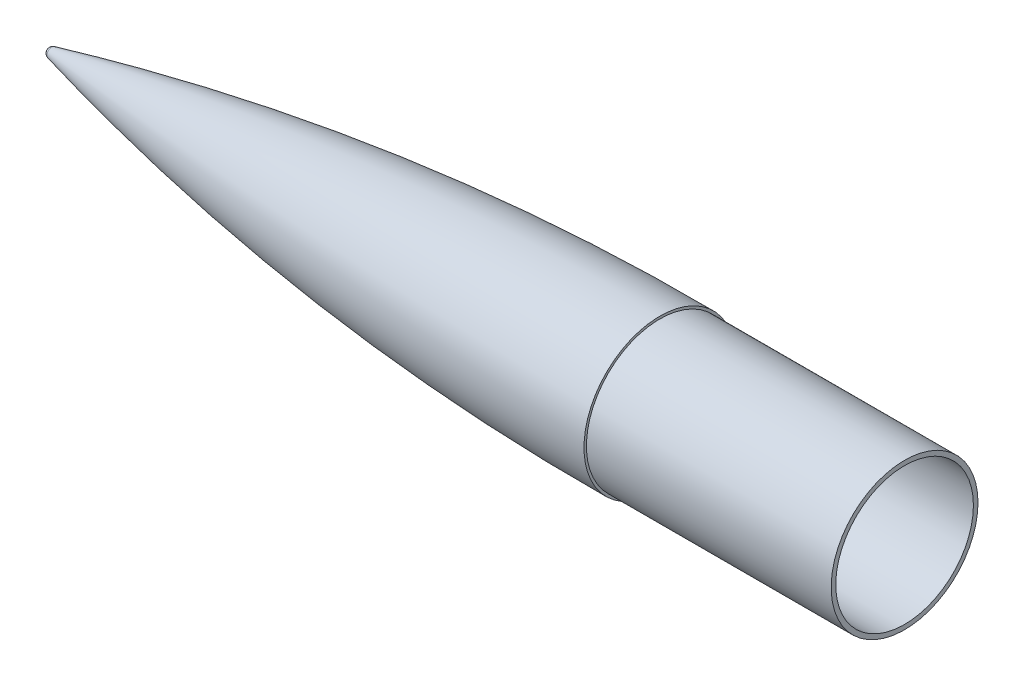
ISO-10303-21;
HEADER;
FILE_DESCRIPTION(('STEP AP214'),'2;1');
FILE_NAME('part.step','',(''),(''),'','','');
FILE_SCHEMA(('AUTOMOTIVE_DESIGN { 1 0 10303 214 1 1 1 1 }'));
ENDSEC;
DATA;
#1=APPLICATION_CONTEXT('core data for automotive mechanical design processes');
#2=APPLICATION_PROTOCOL_DEFINITION('international standard','automotive_design',2000,#1);
#3=PRODUCT_CONTEXT('',#1,'mechanical');
#4=PRODUCT('Part','Part','',(#3));
#5=PRODUCT_RELATED_PRODUCT_CATEGORY('part','',(#4));
#6=PRODUCT_DEFINITION_FORMATION('','',#4);
#7=PRODUCT_DEFINITION_CONTEXT('part definition',#1,'design');
#8=PRODUCT_DEFINITION('design','',#6,#7);
#9=PRODUCT_DEFINITION_SHAPE('','',#8);
#10=(LENGTH_UNIT() NAMED_UNIT(*) SI_UNIT(.MILLI.,.METRE.));
#11=(NAMED_UNIT(*) PLANE_ANGLE_UNIT() SI_UNIT($,.RADIAN.));
#12=(NAMED_UNIT(*) SI_UNIT($,.STERADIAN.) SOLID_ANGLE_UNIT());
#13=UNCERTAINTY_MEASURE_WITH_UNIT(LENGTH_MEASURE(1.E-05),#10,'distance_accuracy_value','');
#14=(GEOMETRIC_REPRESENTATION_CONTEXT(3) GLOBAL_UNCERTAINTY_ASSIGNED_CONTEXT((#13)) GLOBAL_UNIT_ASSIGNED_CONTEXT((#10,
#11,#12)) REPRESENTATION_CONTEXT('',''));
#15=CARTESIAN_POINT('',(0.,0.,0.));
#16=DIRECTION('',(0.,0.,1.));
#17=DIRECTION('',(1.,0.,0.));
#18=AXIS2_PLACEMENT_3D('',#15,#16,#17);
#19=CARTESIAN_POINT('',(317.693317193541,0.,0.));
#20=DIRECTION('',(1.,0.,0.));
#21=DIRECTION('',(0.,0.,-1.));
#22=AXIS2_PLACEMENT_3D('',#19,#20,#21);
#23=DEGENERATE_TOROIDAL_SURFACE('',#22,1261.33745347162,1300.73103112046,.F.);
#24=CARTESIAN_POINT('',(9.96412339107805,0.,0.));
#25=DIRECTION('',(1.,0.,0.));
#26=DIRECTION('',(0.,0.,-1.));
#27=AXIS2_PLACEMENT_3D('',#24,#25,#26);
#28=CIRCLE('',#27,2.46789491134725);
#29=CARTESIAN_POINT('',(9.96412339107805,0.,-2.46789491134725));
#30=VERTEX_POINT('',#29);
#31=EDGE_CURVE('E11',#30,#30,#28,.T.);
#32=ORIENTED_EDGE('',*,*,#31,.T.);
#33=EDGE_LOOP('',(#32));
#34=FACE_BOUND('',#33,.T.);
#35=CARTESIAN_POINT('',(325.525034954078,0.,0.));
#36=DIRECTION('',(1.,0.,0.));
#37=DIRECTION('',(0.,0.,-1.));
#38=AXIS2_PLACEMENT_3D('',#35,#36,#37);
#39=CIRCLE('',#38,39.37);
#40=CARTESIAN_POINT('',(325.525034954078,0.,-39.37));
#41=VERTEX_POINT('',#40);
#42=EDGE_CURVE('E64',#41,#41,#39,.T.);
#43=ORIENTED_EDGE('',*,*,#42,.F.);
#44=EDGE_LOOP('',(#43));
#45=FACE_BOUND('',#44,.T.);
#46=ADVANCED_FACE('F32',(#34,#45),#23,.F.);
#47=CARTESIAN_POINT('',(10.5650349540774,0.,0.));
#48=DIRECTION('',(1.,0.,0.));
#49=DIRECTION('',(0.,1.,0.));
#50=AXIS2_PLACEMENT_3D('',#47,#48,#49);
#51=SPHERICAL_SURFACE('',#50,2.54);
#52=ORIENTED_EDGE('',*,*,#31,.F.);
#53=EDGE_LOOP('',(#52));
#54=FACE_BOUND('',#53,.T.);
#55=ADVANCED_FACE('F44',(#54),#51,.T.);
#56=CARTESIAN_POINT('',(317.693317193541,0.,1261.33745347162));
#57=DIRECTION('',(0.,-1.,0.));
#58=DIRECTION('',(0.,0.,-1.));
#59=AXIS2_PLACEMENT_3D('',#56,#57,#58);
#60=CIRCLE('',#59,1298.34978112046);
#61=TRIMMED_CURVE('',#60,(PARAMETER_VALUE(-0.239347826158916)),
(PARAMETER_VALUE(0.239347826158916)),.T.,.PARAMETER.);
#62=CARTESIAN_POINT('',(317.693317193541,0.,0.));
#63=DIRECTION('',(1.,0.,0.));
#64=AXIS1_PLACEMENT('',#62,#63);
#65=SURFACE_OF_REVOLUTION('',#61,#64);
#66=CARTESIAN_POINT('',(325.51069741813,0.,0.));
#67=DIRECTION('',(1.,0.,0.));
#68=DIRECTION('',(0.,0.,-1.));
#69=AXIS2_PLACEMENT_3D('',#66,#67,#68);
#70=CIRCLE('',#69,36.9887931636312);
#71=CARTESIAN_POINT('',(325.51069741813,0.,-36.9887931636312));
#72=VERTEX_POINT('',#71);
#73=EDGE_CURVE('E38',#72,#72,#70,.T.);
#74=ORIENTED_EDGE('',*,*,#73,.T.);
#75=EDGE_LOOP('',(#74));
#76=FACE_BOUND('',#75,.T.);
#77=CARTESIAN_POINT('',(9.89470997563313,0.,0.));
#78=VERTEX_POINT('',#77);
#79=VERTEX_LOOP('',#78);
#80=FACE_BOUND('',#79,.T.);
#81=ADVANCED_FACE('F41',(#76,#80),#65,.F.);
#82=CARTESIAN_POINT('',(325.51069741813,0.,0.));
#83=DIRECTION('',(-1.,0.,0.));
#84=DIRECTION('',(0.,0.,1.));
#85=AXIS2_PLACEMENT_3D('',#82,#83,#84);
#86=CONICAL_SURFACE('',#85,36.9887931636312,1.55950779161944);
#87=CARTESIAN_POINT('',(325.525034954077,0.,0.));
#88=DIRECTION('',(1.,0.,0.));
#89=DIRECTION('',(0.,0.,-1.));
#90=AXIS2_PLACEMENT_3D('',#87,#88,#89);
#91=CIRCLE('',#90,35.71875);
#92=CARTESIAN_POINT('',(325.525034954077,0.,-35.71875));
#93=VERTEX_POINT('',#92);
#94=EDGE_CURVE('E77',#93,#93,#91,.T.);
#95=ORIENTED_EDGE('',*,*,#94,.T.);
#96=EDGE_LOOP('',(#95));
#97=FACE_BOUND('',#96,.T.);
#98=ORIENTED_EDGE('',*,*,#73,.F.);
#99=EDGE_LOOP('',(#98));
#100=FACE_BOUND('',#99,.T.);
#101=ADVANCED_FACE('F43',(#97,#100),#86,.F.);
#102=CARTESIAN_POINT('',(325.525034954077,0.,0.));
#103=DIRECTION('',(1.,0.,0.));
#104=DIRECTION('',(0.,0.,-1.));
#105=AXIS2_PLACEMENT_3D('',#102,#103,#104);
#106=CYLINDRICAL_SURFACE('',#105,35.71875);
#107=CARTESIAN_POINT('',(452.525034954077,0.,0.));
#108=DIRECTION('',(1.,0.,0.));
#109=DIRECTION('',(0.,0.,-1.));
#110=AXIS2_PLACEMENT_3D('',#107,#108,#109);
#111=CIRCLE('',#110,35.71875);
#112=CARTESIAN_POINT('',(452.525034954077,0.,-35.71875));
#113=VERTEX_POINT('',#112);
#114=EDGE_CURVE('E74',#113,#113,#111,.T.);
#115=ORIENTED_EDGE('',*,*,#114,.T.);
#116=EDGE_LOOP('',(#115));
#117=FACE_BOUND('',#116,.T.);
#118=ORIENTED_EDGE('',*,*,#94,.F.);
#119=EDGE_LOOP('',(#118));
#120=FACE_BOUND('',#119,.T.);
#121=ADVANCED_FACE('F51',(#117,#120),#106,.F.);
#122=CARTESIAN_POINT('',(452.525034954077,38.1,0.));
#123=DIRECTION('',(1.,0.,0.));
#124=DIRECTION('',(0.,0.,-1.));
#125=AXIS2_PLACEMENT_3D('',#122,#123,#124);
#126=PLANE('',#125);
#127=CARTESIAN_POINT('',(452.525034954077,0.,0.));
#128=DIRECTION('',(1.,0.,0.));
#129=DIRECTION('',(0.,0.,-1.));
#130=AXIS2_PLACEMENT_3D('',#127,#128,#129);
#131=CIRCLE('',#130,38.1);
#132=CARTESIAN_POINT('',(452.525034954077,0.,-38.1));
#133=VERTEX_POINT('',#132);
#134=EDGE_CURVE('E69',#133,#133,#131,.T.);
#135=ORIENTED_EDGE('',*,*,#134,.T.);
#136=EDGE_LOOP('',(#135));
#137=FACE_BOUND('',#136,.T.);
#138=ORIENTED_EDGE('',*,*,#114,.F.);
#139=EDGE_LOOP('',(#138));
#140=FACE_BOUND('',#139,.T.);
#141=ADVANCED_FACE('F84',(#137,#140),#126,.T.);
#142=CARTESIAN_POINT('',(325.525034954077,0.,0.));
#143=DIRECTION('',(1.,0.,0.));
#144=DIRECTION('',(0.,0.,-1.));
#145=AXIS2_PLACEMENT_3D('',#142,#143,#144);
#146=CYLINDRICAL_SURFACE('',#145,38.1);
#147=CARTESIAN_POINT('',(325.525034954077,0.,0.));
#148=DIRECTION('',(1.,0.,0.));
#149=DIRECTION('',(0.,0.,-1.));
#150=AXIS2_PLACEMENT_3D('',#147,#148,#149);
#151=CIRCLE('',#150,38.1);
#152=CARTESIAN_POINT('',(325.525034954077,0.,-38.1));
#153=VERTEX_POINT('',#152);
#154=EDGE_CURVE('E66',#153,#153,#151,.T.);
#155=ORIENTED_EDGE('',*,*,#154,.T.);
#156=EDGE_LOOP('',(#155));
#157=FACE_BOUND('',#156,.T.);
#158=ORIENTED_EDGE('',*,*,#134,.F.);
#159=EDGE_LOOP('',(#158));
#160=FACE_BOUND('',#159,.T.);
#161=ADVANCED_FACE('F90',(#157,#160),#146,.T.);
#162=CARTESIAN_POINT('',(325.525034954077,38.1,0.));
#163=DIRECTION('',(1.,0.,0.));
#164=DIRECTION('',(0.,0.,-1.));
#165=AXIS2_PLACEMENT_3D('',#162,#163,#164);
#166=PLANE('',#165);
#167=ORIENTED_EDGE('',*,*,#42,.T.);
#168=EDGE_LOOP('',(#167));
#169=FACE_BOUND('',#168,.T.);
#170=ORIENTED_EDGE('',*,*,#154,.F.);
#171=EDGE_LOOP('',(#170));
#172=FACE_BOUND('',#171,.T.);
#173=ADVANCED_FACE('F96',(#169,#172),#166,.T.);
#174=CLOSED_SHELL('',(#46,#55,#81,#101,#121,#141,#161,#173));
#175=MANIFOLD_SOLID_BREP('B2',#174);
#176=ADVANCED_BREP_SHAPE_REPRESENTATION('',(#18,#175),#14);
#177=SHAPE_DEFINITION_REPRESENTATION(#9,#176);
ENDSEC;
END-ISO-10303-21;
